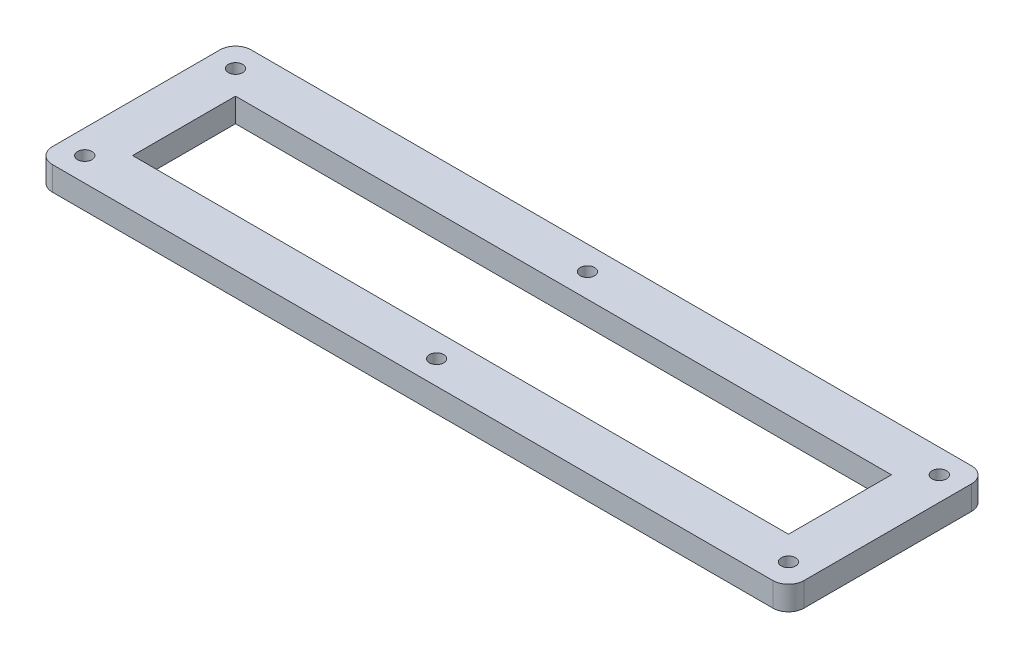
ISO-10303-21;
HEADER;
FILE_DESCRIPTION(('STEP AP214'),'2;1');
FILE_NAME('part.step','',(''),(''),'','','');
FILE_SCHEMA(('AUTOMOTIVE_DESIGN { 1 0 10303 214 1 1 1 1 }'));
ENDSEC;
DATA;
#1=APPLICATION_CONTEXT('core data for automotive mechanical design processes');
#2=APPLICATION_PROTOCOL_DEFINITION('international standard','automotive_design',2000,#1);
#3=PRODUCT_CONTEXT('',#1,'mechanical');
#4=PRODUCT('Part','Part','',(#3));
#5=PRODUCT_RELATED_PRODUCT_CATEGORY('part','',(#4));
#6=PRODUCT_DEFINITION_FORMATION('','',#4);
#7=PRODUCT_DEFINITION_CONTEXT('part definition',#1,'design');
#8=PRODUCT_DEFINITION('design','',#6,#7);
#9=PRODUCT_DEFINITION_SHAPE('','',#8);
#10=(LENGTH_UNIT() NAMED_UNIT(*) SI_UNIT(.MILLI.,.METRE.));
#11=(NAMED_UNIT(*) PLANE_ANGLE_UNIT() SI_UNIT($,.RADIAN.));
#12=(NAMED_UNIT(*) SI_UNIT($,.STERADIAN.) SOLID_ANGLE_UNIT());
#13=UNCERTAINTY_MEASURE_WITH_UNIT(LENGTH_MEASURE(1.E-05),#10,'distance_accuracy_value','');
#14=(GEOMETRIC_REPRESENTATION_CONTEXT(3) GLOBAL_UNCERTAINTY_ASSIGNED_CONTEXT((#13)) GLOBAL_UNIT_ASSIGNED_CONTEXT((#10,
#11,#12)) REPRESENTATION_CONTEXT('',''));
#15=CARTESIAN_POINT('',(0.,0.,0.));
#16=DIRECTION('',(0.,0.,1.));
#17=DIRECTION('',(1.,0.,0.));
#18=AXIS2_PLACEMENT_3D('',#15,#16,#17);
#19=CARTESIAN_POINT('',(0.,5.08,0.));
#20=DIRECTION('',(0.,1.,0.));
#21=DIRECTION('',(0.,0.,1.));
#22=AXIS2_PLACEMENT_3D('',#19,#20,#21);
#23=PLANE('',#22);
#24=CARTESIAN_POINT('',(114.554,5.08,16.002));
#25=DIRECTION('',(0.,-1.,0.));
#26=DIRECTION('',(0.,0.,1.));
#27=AXIS2_PLACEMENT_3D('',#24,#25,#26);
#28=CIRCLE('',#27,1.524);
#29=CARTESIAN_POINT('',(114.554,5.08,17.526));
#30=VERTEX_POINT('',#29);
#31=EDGE_CURVE('E434',#30,#30,#28,.T.);
#32=ORIENTED_EDGE('',*,*,#31,.T.);
#33=EDGE_LOOP('',(#32));
#34=FACE_BOUND('',#33,.T.);
#35=CARTESIAN_POINT('',(114.554,5.08,-16.002));
#36=DIRECTION('',(0.,-1.,0.));
#37=DIRECTION('',(0.,0.,1.));
#38=AXIS2_PLACEMENT_3D('',#35,#36,#37);
#39=CIRCLE('',#38,1.524);
#40=CARTESIAN_POINT('',(114.554,5.08,-14.478));
#41=VERTEX_POINT('',#40);
#42=EDGE_CURVE('E428',#41,#41,#39,.T.);
#43=ORIENTED_EDGE('',*,*,#42,.T.);
#44=EDGE_LOOP('',(#43));
#45=FACE_BOUND('',#44,.T.);
#46=DIRECTION('',(0.,0.,1.));
#47=VECTOR('',#46,1.);
#48=CARTESIAN_POINT('',(119.634,5.08,-21.082));
#49=LINE('',#48,#47);
#50=CARTESIAN_POINT('',(119.634,5.08,-17.78));
#51=VERTEX_POINT('',#50);
#52=CARTESIAN_POINT('',(119.634,5.08,17.78));
#53=VERTEX_POINT('',#52);
#54=EDGE_CURVE('E155',#51,#53,#49,.T.);
#55=ORIENTED_EDGE('',*,*,#54,.F.);
#56=CARTESIAN_POINT('',(116.332,5.08,-17.78));
#57=DIRECTION('',(0.,1.,0.));
#58=DIRECTION('',(0.,0.,1.));
#59=AXIS2_PLACEMENT_3D('',#56,#57,#58);
#60=CIRCLE('',#59,3.302);
#61=CARTESIAN_POINT('',(116.332,5.08,-21.082));
#62=VERTEX_POINT('',#61);
#63=EDGE_CURVE('E43',#51,#62,#60,.T.);
#64=ORIENTED_EDGE('',*,*,#63,.T.);
#65=DIRECTION('',(-1.,0.,0.));
#66=VECTOR('',#65,1.);
#67=CARTESIAN_POINT('',(-39.878,5.08,-21.082));
#68=LINE('',#67,#66);
#69=CARTESIAN_POINT('',(-36.576,5.08,-21.082));
#70=VERTEX_POINT('',#69);
#71=EDGE_CURVE('E191',#62,#70,#68,.T.);
#72=ORIENTED_EDGE('',*,*,#71,.T.);
#73=CARTESIAN_POINT('',(-36.576,5.08,-17.78));
#74=DIRECTION('',(0.,1.,0.));
#75=DIRECTION('',(0.,0.,1.));
#76=AXIS2_PLACEMENT_3D('',#73,#74,#75);
#77=CIRCLE('',#76,3.302);
#78=CARTESIAN_POINT('',(-39.878,5.08,-17.78));
#79=VERTEX_POINT('',#78);
#80=EDGE_CURVE('E219',#70,#79,#77,.T.);
#81=ORIENTED_EDGE('',*,*,#80,.T.);
#82=DIRECTION('',(0.,0.,1.));
#83=VECTOR('',#82,1.);
#84=CARTESIAN_POINT('',(-39.878,5.08,-21.082));
#85=LINE('',#84,#83);
#86=CARTESIAN_POINT('',(-39.878,5.08,17.78));
#87=VERTEX_POINT('',#86);
#88=EDGE_CURVE('E193',#79,#87,#85,.T.);
#89=ORIENTED_EDGE('',*,*,#88,.T.);
#90=CARTESIAN_POINT('',(-36.576,5.08,17.78));
#91=DIRECTION('',(0.,1.,0.));
#92=DIRECTION('',(0.,0.,1.));
#93=AXIS2_PLACEMENT_3D('',#90,#91,#92);
#94=CIRCLE('',#93,3.302);
#95=CARTESIAN_POINT('',(-36.576,5.08,21.082));
#96=VERTEX_POINT('',#95);
#97=EDGE_CURVE('E217',#87,#96,#94,.T.);
#98=ORIENTED_EDGE('',*,*,#97,.T.);
#99=DIRECTION('',(1.,0.,0.));
#100=VECTOR('',#99,1.);
#101=CARTESIAN_POINT('',(-39.878,5.08,21.082));
#102=LINE('',#101,#100);
#103=CARTESIAN_POINT('',(116.332,5.08,21.082));
#104=VERTEX_POINT('',#103);
#105=EDGE_CURVE('E197',#96,#104,#102,.T.);
#106=ORIENTED_EDGE('',*,*,#105,.T.);
#107=CARTESIAN_POINT('',(116.332,5.08,17.78));
#108=DIRECTION('',(0.,1.,0.));
#109=DIRECTION('',(0.,0.,1.));
#110=AXIS2_PLACEMENT_3D('',#107,#108,#109);
#111=CIRCLE('',#110,3.302);
#112=EDGE_CURVE('E55',#104,#53,#111,.T.);
#113=ORIENTED_EDGE('',*,*,#112,.T.);
#114=EDGE_LOOP('',(#55,#64,#72,#81,#89,#98,#106,#113));
#115=FACE_BOUND('',#114,.T.);
#116=CARTESIAN_POINT('',(39.878,5.08,-16.002));
#117=DIRECTION('',(0.,1.,0.));
#118=DIRECTION('',(0.,0.,1.));
#119=AXIS2_PLACEMENT_3D('',#116,#117,#118);
#120=CIRCLE('',#119,1.524);
#121=CARTESIAN_POINT('',(39.878,5.08,-14.478));
#122=VERTEX_POINT('',#121);
#123=EDGE_CURVE('E163',#122,#122,#120,.T.);
#124=ORIENTED_EDGE('',*,*,#123,.F.);
#125=EDGE_LOOP('',(#124));
#126=FACE_BOUND('',#125,.T.);
#127=CARTESIAN_POINT('',(39.878,5.08,16.002));
#128=DIRECTION('',(0.,1.,0.));
#129=DIRECTION('',(0.,0.,1.));
#130=AXIS2_PLACEMENT_3D('',#127,#128,#129);
#131=CIRCLE('',#130,1.524);
#132=CARTESIAN_POINT('',(39.878,5.08,17.526));
#133=VERTEX_POINT('',#132);
#134=EDGE_CURVE('E157',#133,#133,#131,.T.);
#135=ORIENTED_EDGE('',*,*,#134,.F.);
#136=EDGE_LOOP('',(#135));
#137=FACE_BOUND('',#136,.T.);
#138=CARTESIAN_POINT('',(-34.798,5.08,16.002));
#139=DIRECTION('',(0.,1.,0.));
#140=DIRECTION('',(0.,0.,1.));
#141=AXIS2_PLACEMENT_3D('',#138,#139,#140);
#142=CIRCLE('',#141,1.524);
#143=CARTESIAN_POINT('',(-34.798,5.08,17.526));
#144=VERTEX_POINT('',#143);
#145=EDGE_CURVE('E162',#144,#144,#142,.T.);
#146=ORIENTED_EDGE('',*,*,#145,.F.);
#147=EDGE_LOOP('',(#146));
#148=FACE_BOUND('',#147,.T.);
#149=CARTESIAN_POINT('',(-34.798,5.08,-16.002));
#150=DIRECTION('',(0.,1.,0.));
#151=DIRECTION('',(0.,0.,1.));
#152=AXIS2_PLACEMENT_3D('',#149,#150,#151);
#153=CIRCLE('',#152,1.524);
#154=CARTESIAN_POINT('',(-34.798,5.08,-14.478));
#155=VERTEX_POINT('',#154);
#156=EDGE_CURVE('E166',#155,#155,#153,.T.);
#157=ORIENTED_EDGE('',*,*,#156,.F.);
#158=EDGE_LOOP('',(#157));
#159=FACE_BOUND('',#158,.T.);
#160=DIRECTION('',(-1.,0.,0.));
#161=VECTOR('',#160,1.);
#162=CARTESIAN_POINT('',(39.878,5.08,-10.922));
#163=LINE('',#162,#161);
#164=CARTESIAN_POINT('',(109.474,5.08,-10.922));
#165=VERTEX_POINT('',#164);
#166=CARTESIAN_POINT('',(-29.718,5.08,-10.922));
#167=VERTEX_POINT('',#166);
#168=EDGE_CURVE('E175',#165,#167,#163,.T.);
#169=ORIENTED_EDGE('',*,*,#168,.F.);
#170=DIRECTION('',(0.,0.,1.));
#171=VECTOR('',#170,1.);
#172=CARTESIAN_POINT('',(109.474,5.08,-10.922));
#173=LINE('',#172,#171);
#174=CARTESIAN_POINT('',(109.474,5.08,10.922));
#175=VERTEX_POINT('',#174);
#176=EDGE_CURVE('E145',#165,#175,#173,.T.);
#177=ORIENTED_EDGE('',*,*,#176,.T.);
#178=DIRECTION('',(1.,0.,0.));
#179=VECTOR('',#178,1.);
#180=CARTESIAN_POINT('',(39.878,5.08,10.922));
#181=LINE('',#180,#179);
#182=CARTESIAN_POINT('',(-29.718,5.08,10.922));
#183=VERTEX_POINT('',#182);
#184=EDGE_CURVE('E149',#183,#175,#181,.T.);
#185=ORIENTED_EDGE('',*,*,#184,.F.);
#186=DIRECTION('',(0.,0.,1.));
#187=VECTOR('',#186,1.);
#188=CARTESIAN_POINT('',(-29.718,5.08,-10.922));
#189=LINE('',#188,#187);
#190=EDGE_CURVE('E183',#167,#183,#189,.T.);
#191=ORIENTED_EDGE('',*,*,#190,.F.);
#192=EDGE_LOOP('',(#169,#177,#185,#191));
#193=FACE_BOUND('',#192,.T.);
#194=ADVANCED_FACE('F35',(#34,#45,#115,#126,#137,#148,#159,#193),#23,.T.);
#195=CARTESIAN_POINT('',(0.,0.,0.));
#196=DIRECTION('',(0.,1.,0.));
#197=DIRECTION('',(0.,0.,1.));
#198=AXIS2_PLACEMENT_3D('',#195,#196,#197);
#199=PLANE('',#198);
#200=CARTESIAN_POINT('',(39.878,0.,-16.002));
#201=DIRECTION('',(0.,1.,0.));
#202=DIRECTION('',(0.,0.,1.));
#203=AXIS2_PLACEMENT_3D('',#200,#201,#202);
#204=CIRCLE('',#203,1.524);
#205=CARTESIAN_POINT('',(39.878,0.,-14.478));
#206=VERTEX_POINT('',#205);
#207=EDGE_CURVE('E227',#206,#206,#204,.T.);
#208=ORIENTED_EDGE('',*,*,#207,.T.);
#209=EDGE_LOOP('',(#208));
#210=FACE_BOUND('',#209,.T.);
#211=CARTESIAN_POINT('',(114.554,0.,16.002));
#212=DIRECTION('',(0.,-1.,0.));
#213=DIRECTION('',(0.,0.,1.));
#214=AXIS2_PLACEMENT_3D('',#211,#212,#213);
#215=CIRCLE('',#214,1.524);
#216=CARTESIAN_POINT('',(114.554,0.,17.526));
#217=VERTEX_POINT('',#216);
#218=EDGE_CURVE('E432',#217,#217,#215,.T.);
#219=ORIENTED_EDGE('',*,*,#218,.F.);
#220=EDGE_LOOP('',(#219));
#221=FACE_BOUND('',#220,.T.);
#222=CARTESIAN_POINT('',(39.878,0.,16.002));
#223=DIRECTION('',(0.,1.,0.));
#224=DIRECTION('',(0.,0.,1.));
#225=AXIS2_PLACEMENT_3D('',#222,#223,#224);
#226=CIRCLE('',#225,1.524);
#227=CARTESIAN_POINT('',(39.878,0.,17.526));
#228=VERTEX_POINT('',#227);
#229=EDGE_CURVE('E224',#228,#228,#226,.T.);
#230=ORIENTED_EDGE('',*,*,#229,.T.);
#231=EDGE_LOOP('',(#230));
#232=FACE_BOUND('',#231,.T.);
#233=CARTESIAN_POINT('',(114.554,0.,-16.002));
#234=DIRECTION('',(0.,-1.,0.));
#235=DIRECTION('',(0.,0.,1.));
#236=AXIS2_PLACEMENT_3D('',#233,#234,#235);
#237=CIRCLE('',#236,1.524);
#238=CARTESIAN_POINT('',(114.554,0.,-14.478));
#239=VERTEX_POINT('',#238);
#240=EDGE_CURVE('E426',#239,#239,#237,.T.);
#241=ORIENTED_EDGE('',*,*,#240,.F.);
#242=EDGE_LOOP('',(#241));
#243=FACE_BOUND('',#242,.T.);
#244=CARTESIAN_POINT('',(-34.798,0.,-16.002));
#245=DIRECTION('',(0.,1.,0.));
#246=DIRECTION('',(0.,0.,1.));
#247=AXIS2_PLACEMENT_3D('',#244,#245,#246);
#248=CIRCLE('',#247,1.524);
#249=CARTESIAN_POINT('',(-34.798,0.,-14.478));
#250=VERTEX_POINT('',#249);
#251=EDGE_CURVE('E172',#250,#250,#248,.T.);
#252=ORIENTED_EDGE('',*,*,#251,.T.);
#253=EDGE_LOOP('',(#252));
#254=FACE_BOUND('',#253,.T.);
#255=CARTESIAN_POINT('',(-34.798,0.,16.002));
#256=DIRECTION('',(0.,1.,0.));
#257=DIRECTION('',(0.,0.,1.));
#258=AXIS2_PLACEMENT_3D('',#255,#256,#257);
#259=CIRCLE('',#258,1.524);
#260=CARTESIAN_POINT('',(-34.798,0.,17.526));
#261=VERTEX_POINT('',#260);
#262=EDGE_CURVE('E167',#261,#261,#259,.T.);
#263=ORIENTED_EDGE('',*,*,#262,.T.);
#264=EDGE_LOOP('',(#263));
#265=FACE_BOUND('',#264,.T.);
#266=DIRECTION('',(-1.,0.,0.));
#267=VECTOR('',#266,1.);
#268=CARTESIAN_POINT('',(-39.878,0.,-21.082));
#269=LINE('',#268,#267);
#270=CARTESIAN_POINT('',(116.332,0.,-21.082));
#271=VERTEX_POINT('',#270);
#272=CARTESIAN_POINT('',(-36.576,0.,-21.082));
#273=VERTEX_POINT('',#272);
#274=EDGE_CURVE('E189',#271,#273,#269,.T.);
#275=ORIENTED_EDGE('',*,*,#274,.F.);
#276=CARTESIAN_POINT('',(116.332,0.,-17.78));
#277=DIRECTION('',(0.,1.,0.));
#278=DIRECTION('',(0.,0.,1.));
#279=AXIS2_PLACEMENT_3D('',#276,#277,#278);
#280=CIRCLE('',#279,3.302);
#281=CARTESIAN_POINT('',(119.634,0.,-17.78));
#282=VERTEX_POINT('',#281);
#283=EDGE_CURVE('E235',#271,#282,#280,.F.);
#284=ORIENTED_EDGE('',*,*,#283,.T.);
#285=DIRECTION('',(0.,0.,1.));
#286=VECTOR('',#285,1.);
#287=CARTESIAN_POINT('',(119.634,0.,-21.082));
#288=LINE('',#287,#286);
#289=CARTESIAN_POINT('',(119.634,0.,17.78));
#290=VERTEX_POINT('',#289);
#291=EDGE_CURVE('E151',#282,#290,#288,.T.);
#292=ORIENTED_EDGE('',*,*,#291,.T.);
#293=CARTESIAN_POINT('',(116.332,0.,17.78));
#294=DIRECTION('',(0.,1.,0.));
#295=DIRECTION('',(0.,0.,1.));
#296=AXIS2_PLACEMENT_3D('',#293,#294,#295);
#297=CIRCLE('',#296,3.302);
#298=CARTESIAN_POINT('',(116.332,0.,21.082));
#299=VERTEX_POINT('',#298);
#300=EDGE_CURVE('E233',#290,#299,#297,.F.);
#301=ORIENTED_EDGE('',*,*,#300,.T.);
#302=DIRECTION('',(1.,0.,0.));
#303=VECTOR('',#302,1.);
#304=CARTESIAN_POINT('',(-39.878,0.,21.082));
#305=LINE('',#304,#303);
#306=CARTESIAN_POINT('',(-36.576,0.,21.082));
#307=VERTEX_POINT('',#306);
#308=EDGE_CURVE('E194',#307,#299,#305,.T.);
#309=ORIENTED_EDGE('',*,*,#308,.F.);
#310=CARTESIAN_POINT('',(-36.576,0.,17.78));
#311=DIRECTION('',(0.,1.,0.));
#312=DIRECTION('',(0.,0.,1.));
#313=AXIS2_PLACEMENT_3D('',#310,#311,#312);
#314=CIRCLE('',#313,3.302);
#315=CARTESIAN_POINT('',(-39.878,0.,17.78));
#316=VERTEX_POINT('',#315);
#317=EDGE_CURVE('E209',#307,#316,#314,.F.);
#318=ORIENTED_EDGE('',*,*,#317,.T.);
#319=DIRECTION('',(0.,0.,1.));
#320=VECTOR('',#319,1.);
#321=CARTESIAN_POINT('',(-39.878,0.,-21.082));
#322=LINE('',#321,#320);
#323=CARTESIAN_POINT('',(-39.878,0.,-17.78));
#324=VERTEX_POINT('',#323);
#325=EDGE_CURVE('E201',#324,#316,#322,.T.);
#326=ORIENTED_EDGE('',*,*,#325,.F.);
#327=CARTESIAN_POINT('',(-36.576,0.,-17.78));
#328=DIRECTION('',(0.,1.,0.));
#329=DIRECTION('',(0.,0.,1.));
#330=AXIS2_PLACEMENT_3D('',#327,#328,#329);
#331=CIRCLE('',#330,3.302);
#332=EDGE_CURVE('E211',#324,#273,#331,.F.);
#333=ORIENTED_EDGE('',*,*,#332,.T.);
#334=EDGE_LOOP('',(#275,#284,#292,#301,#309,#318,#326,#333));
#335=FACE_BOUND('',#334,.T.);
#336=DIRECTION('',(0.,0.,1.));
#337=VECTOR('',#336,1.);
#338=CARTESIAN_POINT('',(109.474,0.,-10.922));
#339=LINE('',#338,#337);
#340=CARTESIAN_POINT('',(109.474,0.,-10.922));
#341=VERTEX_POINT('',#340);
#342=CARTESIAN_POINT('',(109.474,0.,10.922));
#343=VERTEX_POINT('',#342);
#344=EDGE_CURVE('E130',#341,#343,#339,.T.);
#345=ORIENTED_EDGE('',*,*,#344,.F.);
#346=DIRECTION('',(-1.,0.,0.));
#347=VECTOR('',#346,1.);
#348=CARTESIAN_POINT('',(39.878,0.,-10.922));
#349=LINE('',#348,#347);
#350=CARTESIAN_POINT('',(-29.718,0.,-10.922));
#351=VERTEX_POINT('',#350);
#352=EDGE_CURVE('E178',#341,#351,#349,.T.);
#353=ORIENTED_EDGE('',*,*,#352,.T.);
#354=DIRECTION('',(0.,0.,1.));
#355=VECTOR('',#354,1.);
#356=CARTESIAN_POINT('',(-29.718,0.,-10.922));
#357=LINE('',#356,#355);
#358=CARTESIAN_POINT('',(-29.718,0.,10.922));
#359=VERTEX_POINT('',#358);
#360=EDGE_CURVE('E131',#351,#359,#357,.T.);
#361=ORIENTED_EDGE('',*,*,#360,.T.);
#362=DIRECTION('',(1.,0.,0.));
#363=VECTOR('',#362,1.);
#364=CARTESIAN_POINT('',(39.878,0.,10.922));
#365=LINE('',#364,#363);
#366=EDGE_CURVE('E126',#359,#343,#365,.T.);
#367=ORIENTED_EDGE('',*,*,#366,.T.);
#368=EDGE_LOOP('',(#345,#353,#361,#367));
#369=FACE_BOUND('',#368,.T.);
#370=ADVANCED_FACE('F128',(#210,#221,#232,#243,#254,#265,#335,#369),#199,.F.);
#371=CARTESIAN_POINT('',(-39.878,5.08,-21.082));
#372=DIRECTION('',(0.,0.,1.));
#373=DIRECTION('',(1.,0.,0.));
#374=AXIS2_PLACEMENT_3D('',#371,#372,#373);
#375=PLANE('',#374);
#376=ORIENTED_EDGE('',*,*,#71,.F.);
#377=DIRECTION('',(0.,-1.,0.));
#378=VECTOR('',#377,1.);
#379=CARTESIAN_POINT('',(116.332,0.,-21.082));
#380=LINE('',#379,#378);
#381=EDGE_CURVE('E230',#62,#271,#380,.T.);
#382=ORIENTED_EDGE('',*,*,#381,.T.);
#383=ORIENTED_EDGE('',*,*,#274,.T.);
#384=DIRECTION('',(0.,-1.,0.));
#385=VECTOR('',#384,1.);
#386=CARTESIAN_POINT('',(-36.576,5.08,-21.082));
#387=LINE('',#386,#385);
#388=EDGE_CURVE('E214',#273,#70,#387,.F.);
#389=ORIENTED_EDGE('',*,*,#388,.T.);
#390=EDGE_LOOP('',(#376,#382,#383,#389));
#391=FACE_BOUND('',#390,.T.);
#392=ADVANCED_FACE('F249',(#391),#375,.F.);
#393=CARTESIAN_POINT('',(-39.878,5.08,-21.082));
#394=DIRECTION('',(1.,0.,0.));
#395=DIRECTION('',(0.,0.,-1.));
#396=AXIS2_PLACEMENT_3D('',#393,#394,#395);
#397=PLANE('',#396);
#398=ORIENTED_EDGE('',*,*,#88,.F.);
#399=DIRECTION('',(0.,-1.,0.));
#400=VECTOR('',#399,1.);
#401=CARTESIAN_POINT('',(-39.878,5.08,-17.78));
#402=LINE('',#401,#400);
#403=EDGE_CURVE('E206',#79,#324,#402,.T.);
#404=ORIENTED_EDGE('',*,*,#403,.T.);
#405=ORIENTED_EDGE('',*,*,#325,.T.);
#406=DIRECTION('',(0.,-1.,0.));
#407=VECTOR('',#406,1.);
#408=CARTESIAN_POINT('',(-39.878,5.08,17.78));
#409=LINE('',#408,#407);
#410=EDGE_CURVE('E199',#316,#87,#409,.F.);
#411=ORIENTED_EDGE('',*,*,#410,.T.);
#412=EDGE_LOOP('',(#398,#404,#405,#411));
#413=FACE_BOUND('',#412,.T.);
#414=ADVANCED_FACE('F270',(#413),#397,.F.);
#415=CARTESIAN_POINT('',(-39.878,5.08,21.082));
#416=DIRECTION('',(0.,0.,-1.));
#417=DIRECTION('',(-1.,0.,0.));
#418=AXIS2_PLACEMENT_3D('',#415,#416,#417);
#419=PLANE('',#418);
#420=ORIENTED_EDGE('',*,*,#308,.T.);
#421=DIRECTION('',(0.,-1.,0.));
#422=VECTOR('',#421,1.);
#423=CARTESIAN_POINT('',(116.332,5.08,21.082));
#424=LINE('',#423,#422);
#425=EDGE_CURVE('E11',#299,#104,#424,.F.);
#426=ORIENTED_EDGE('',*,*,#425,.T.);
#427=ORIENTED_EDGE('',*,*,#105,.F.);
#428=DIRECTION('',(0.,-1.,0.));
#429=VECTOR('',#428,1.);
#430=CARTESIAN_POINT('',(-36.576,5.08,21.082));
#431=LINE('',#430,#429);
#432=EDGE_CURVE('E221',#96,#307,#431,.T.);
#433=ORIENTED_EDGE('',*,*,#432,.T.);
#434=EDGE_LOOP('',(#420,#426,#427,#433));
#435=FACE_BOUND('',#434,.T.);
#436=ADVANCED_FACE('F261',(#435),#419,.F.);
#437=CARTESIAN_POINT('',(-36.576,5.08,-17.78));
#438=DIRECTION('',(0.,-1.,0.));
#439=DIRECTION('',(0.,0.,-1.));
#440=AXIS2_PLACEMENT_3D('',#437,#438,#439);
#441=CYLINDRICAL_SURFACE('',#440,3.302);
#442=ORIENTED_EDGE('',*,*,#80,.F.);
#443=ORIENTED_EDGE('',*,*,#388,.F.);
#444=ORIENTED_EDGE('',*,*,#332,.F.);
#445=ORIENTED_EDGE('',*,*,#403,.F.);
#446=EDGE_LOOP('',(#442,#443,#444,#445));
#447=FACE_BOUND('',#446,.T.);
#448=ADVANCED_FACE('F273',(#447),#441,.T.);
#449=CARTESIAN_POINT('',(-36.576,5.08,17.78));
#450=DIRECTION('',(0.,-1.,0.));
#451=DIRECTION('',(0.,0.,-1.));
#452=AXIS2_PLACEMENT_3D('',#449,#450,#451);
#453=CYLINDRICAL_SURFACE('',#452,3.302);
#454=ORIENTED_EDGE('',*,*,#97,.F.);
#455=ORIENTED_EDGE('',*,*,#410,.F.);
#456=ORIENTED_EDGE('',*,*,#317,.F.);
#457=ORIENTED_EDGE('',*,*,#432,.F.);
#458=EDGE_LOOP('',(#454,#455,#456,#457));
#459=FACE_BOUND('',#458,.T.);
#460=ADVANCED_FACE('F265',(#459),#453,.T.);
#461=CARTESIAN_POINT('',(39.878,0.,10.922));
#462=DIRECTION('',(0.,0.,1.));
#463=DIRECTION('',(1.,0.,0.));
#464=AXIS2_PLACEMENT_3D('',#461,#462,#463);
#465=PLANE('',#464);
#466=ORIENTED_EDGE('',*,*,#184,.T.);
#467=DIRECTION('',(0.,1.,0.));
#468=VECTOR('',#467,1.);
#469=CARTESIAN_POINT('',(109.474,0.,10.922));
#470=LINE('',#469,#468);
#471=EDGE_CURVE('E141',#343,#175,#470,.T.);
#472=ORIENTED_EDGE('',*,*,#471,.F.);
#473=ORIENTED_EDGE('',*,*,#366,.F.);
#474=DIRECTION('',(0.,1.,0.));
#475=VECTOR('',#474,1.);
#476=CARTESIAN_POINT('',(-29.718,0.,10.922));
#477=LINE('',#476,#475);
#478=EDGE_CURVE('E187',#359,#183,#477,.T.);
#479=ORIENTED_EDGE('',*,*,#478,.T.);
#480=EDGE_LOOP('',(#466,#472,#473,#479));
#481=FACE_BOUND('',#480,.T.);
#482=ADVANCED_FACE('F147',(#481),#465,.F.);
#483=CARTESIAN_POINT('',(-29.718,0.,-10.922));
#484=DIRECTION('',(-1.,0.,0.));
#485=DIRECTION('',(0.,0.,1.));
#486=AXIS2_PLACEMENT_3D('',#483,#484,#485);
#487=PLANE('',#486);
#488=ORIENTED_EDGE('',*,*,#190,.T.);
#489=ORIENTED_EDGE('',*,*,#478,.F.);
#490=ORIENTED_EDGE('',*,*,#360,.F.);
#491=DIRECTION('',(0.,1.,0.));
#492=VECTOR('',#491,1.);
#493=CARTESIAN_POINT('',(-29.718,0.,-10.922));
#494=LINE('',#493,#492);
#495=EDGE_CURVE('E134',#351,#167,#494,.T.);
#496=ORIENTED_EDGE('',*,*,#495,.T.);
#497=EDGE_LOOP('',(#488,#489,#490,#496));
#498=FACE_BOUND('',#497,.T.);
#499=ADVANCED_FACE('F322',(#498),#487,.F.);
#500=CARTESIAN_POINT('',(39.878,0.,-10.922));
#501=DIRECTION('',(0.,0.,-1.));
#502=DIRECTION('',(-1.,0.,0.));
#503=AXIS2_PLACEMENT_3D('',#500,#501,#502);
#504=PLANE('',#503);
#505=ORIENTED_EDGE('',*,*,#168,.T.);
#506=ORIENTED_EDGE('',*,*,#495,.F.);
#507=ORIENTED_EDGE('',*,*,#352,.F.);
#508=DIRECTION('',(0.,1.,0.));
#509=VECTOR('',#508,1.);
#510=CARTESIAN_POINT('',(109.474,0.,-10.922));
#511=LINE('',#510,#509);
#512=EDGE_CURVE('E144',#341,#165,#511,.T.);
#513=ORIENTED_EDGE('',*,*,#512,.T.);
#514=EDGE_LOOP('',(#505,#506,#507,#513));
#515=FACE_BOUND('',#514,.T.);
#516=ADVANCED_FACE('F294',(#515),#504,.F.);
#517=CARTESIAN_POINT('',(-34.798,0.,-16.002));
#518=DIRECTION('',(0.,1.,0.));
#519=DIRECTION('',(0.,0.,1.));
#520=AXIS2_PLACEMENT_3D('',#517,#518,#519);
#521=CYLINDRICAL_SURFACE('',#520,1.524);
#522=ORIENTED_EDGE('',*,*,#251,.F.);
#523=EDGE_LOOP('',(#522));
#524=FACE_BOUND('',#523,.T.);
#525=ORIENTED_EDGE('',*,*,#156,.T.);
#526=EDGE_LOOP('',(#525));
#527=FACE_BOUND('',#526,.T.);
#528=ADVANCED_FACE('F334',(#524,#527),#521,.F.);
#529=CARTESIAN_POINT('',(39.878,0.,16.002));
#530=DIRECTION('',(0.,1.,0.));
#531=DIRECTION('',(0.,0.,1.));
#532=AXIS2_PLACEMENT_3D('',#529,#530,#531);
#533=CYLINDRICAL_SURFACE('',#532,1.524);
#534=ORIENTED_EDGE('',*,*,#134,.T.);
#535=EDGE_LOOP('',(#534));
#536=FACE_BOUND('',#535,.T.);
#537=ORIENTED_EDGE('',*,*,#229,.F.);
#538=EDGE_LOOP('',(#537));
#539=FACE_BOUND('',#538,.T.);
#540=ADVANCED_FACE('F342',(#536,#539),#533,.F.);
#541=CARTESIAN_POINT('',(-34.798,0.,16.002));
#542=DIRECTION('',(0.,1.,0.));
#543=DIRECTION('',(0.,0.,1.));
#544=AXIS2_PLACEMENT_3D('',#541,#542,#543);
#545=CYLINDRICAL_SURFACE('',#544,1.524);
#546=ORIENTED_EDGE('',*,*,#262,.F.);
#547=EDGE_LOOP('',(#546));
#548=FACE_BOUND('',#547,.T.);
#549=ORIENTED_EDGE('',*,*,#145,.T.);
#550=EDGE_LOOP('',(#549));
#551=FACE_BOUND('',#550,.T.);
#552=ADVANCED_FACE('F347',(#548,#551),#545,.F.);
#553=CARTESIAN_POINT('',(39.878,0.,-16.002));
#554=DIRECTION('',(0.,1.,0.));
#555=DIRECTION('',(0.,0.,1.));
#556=AXIS2_PLACEMENT_3D('',#553,#554,#555);
#557=CYLINDRICAL_SURFACE('',#556,1.524);
#558=ORIENTED_EDGE('',*,*,#123,.T.);
#559=EDGE_LOOP('',(#558));
#560=FACE_BOUND('',#559,.T.);
#561=ORIENTED_EDGE('',*,*,#207,.F.);
#562=EDGE_LOOP('',(#561));
#563=FACE_BOUND('',#562,.T.);
#564=ADVANCED_FACE('F356',(#560,#563),#557,.F.);
#565=CARTESIAN_POINT('',(119.634,5.08,-21.082));
#566=DIRECTION('',(1.,0.,0.));
#567=DIRECTION('',(0.,0.,-1.));
#568=AXIS2_PLACEMENT_3D('',#565,#566,#567);
#569=PLANE('',#568);
#570=ORIENTED_EDGE('',*,*,#291,.F.);
#571=DIRECTION('',(0.,-1.,0.));
#572=VECTOR('',#571,1.);
#573=CARTESIAN_POINT('',(119.634,5.08,-17.78));
#574=LINE('',#573,#572);
#575=EDGE_CURVE('E240',#282,#51,#574,.F.);
#576=ORIENTED_EDGE('',*,*,#575,.T.);
#577=ORIENTED_EDGE('',*,*,#54,.T.);
#578=DIRECTION('',(0.,-1.,0.));
#579=VECTOR('',#578,1.);
#580=CARTESIAN_POINT('',(119.634,0.,17.78));
#581=LINE('',#580,#579);
#582=EDGE_CURVE('E237',#53,#290,#581,.T.);
#583=ORIENTED_EDGE('',*,*,#582,.T.);
#584=EDGE_LOOP('',(#570,#576,#577,#583));
#585=FACE_BOUND('',#584,.T.);
#586=ADVANCED_FACE('F257',(#585),#569,.T.);
#587=CARTESIAN_POINT('',(116.332,5.08,-17.78));
#588=DIRECTION('',(0.,1.,0.));
#589=DIRECTION('',(0.,0.,1.));
#590=AXIS2_PLACEMENT_3D('',#587,#588,#589);
#591=CYLINDRICAL_SURFACE('',#590,3.302);
#592=ORIENTED_EDGE('',*,*,#63,.F.);
#593=ORIENTED_EDGE('',*,*,#575,.F.);
#594=ORIENTED_EDGE('',*,*,#283,.F.);
#595=ORIENTED_EDGE('',*,*,#381,.F.);
#596=EDGE_LOOP('',(#592,#593,#594,#595));
#597=FACE_BOUND('',#596,.T.);
#598=ADVANCED_FACE('F253',(#597),#591,.T.);
#599=CARTESIAN_POINT('',(116.332,5.08,17.78));
#600=DIRECTION('',(0.,1.,0.));
#601=DIRECTION('',(0.,0.,1.));
#602=AXIS2_PLACEMENT_3D('',#599,#600,#601);
#603=CYLINDRICAL_SURFACE('',#602,3.302);
#604=ORIENTED_EDGE('',*,*,#112,.F.);
#605=ORIENTED_EDGE('',*,*,#425,.F.);
#606=ORIENTED_EDGE('',*,*,#300,.F.);
#607=ORIENTED_EDGE('',*,*,#582,.F.);
#608=EDGE_LOOP('',(#604,#605,#606,#607));
#609=FACE_BOUND('',#608,.T.);
#610=ADVANCED_FACE('F37',(#609),#603,.T.);
#611=CARTESIAN_POINT('',(109.474,0.,-10.922));
#612=DIRECTION('',(-1.,0.,0.));
#613=DIRECTION('',(0.,0.,1.));
#614=AXIS2_PLACEMENT_3D('',#611,#612,#613);
#615=PLANE('',#614);
#616=ORIENTED_EDGE('',*,*,#176,.F.);
#617=ORIENTED_EDGE('',*,*,#512,.F.);
#618=ORIENTED_EDGE('',*,*,#344,.T.);
#619=ORIENTED_EDGE('',*,*,#471,.T.);
#620=EDGE_LOOP('',(#616,#617,#618,#619));
#621=FACE_BOUND('',#620,.T.);
#622=ADVANCED_FACE('F140',(#621),#615,.T.);
#623=CARTESIAN_POINT('',(114.554,0.,-16.002));
#624=DIRECTION('',(0.,1.,0.));
#625=DIRECTION('',(0.,0.,1.));
#626=AXIS2_PLACEMENT_3D('',#623,#624,#625);
#627=CYLINDRICAL_SURFACE('',#626,1.524);
#628=ORIENTED_EDGE('',*,*,#240,.T.);
#629=EDGE_LOOP('',(#628));
#630=FACE_BOUND('',#629,.T.);
#631=ORIENTED_EDGE('',*,*,#42,.F.);
#632=EDGE_LOOP('',(#631));
#633=FACE_BOUND('',#632,.T.);
#634=ADVANCED_FACE('F392',(#630,#633),#627,.F.);
#635=CARTESIAN_POINT('',(114.554,0.,16.002));
#636=DIRECTION('',(0.,1.,0.));
#637=DIRECTION('',(0.,0.,1.));
#638=AXIS2_PLACEMENT_3D('',#635,#636,#637);
#639=CYLINDRICAL_SURFACE('',#638,1.524);
#640=ORIENTED_EDGE('',*,*,#218,.T.);
#641=EDGE_LOOP('',(#640));
#642=FACE_BOUND('',#641,.T.);
#643=ORIENTED_EDGE('',*,*,#31,.F.);
#644=EDGE_LOOP('',(#643));
#645=FACE_BOUND('',#644,.T.);
#646=ADVANCED_FACE('F400',(#642,#645),#639,.F.);
#647=CLOSED_SHELL('',(#194,#370,#392,#414,#436,#448,#460,#482,#499,#516,#528,#540,#552,#564,
#586,#598,#610,#622,#634,#646));
#648=MANIFOLD_SOLID_BREP('B2',#647);
#649=ADVANCED_BREP_SHAPE_REPRESENTATION('',(#18,#648),#14);
#650=SHAPE_DEFINITION_REPRESENTATION(#9,#649);
ENDSEC;
END-ISO-10303-21;
